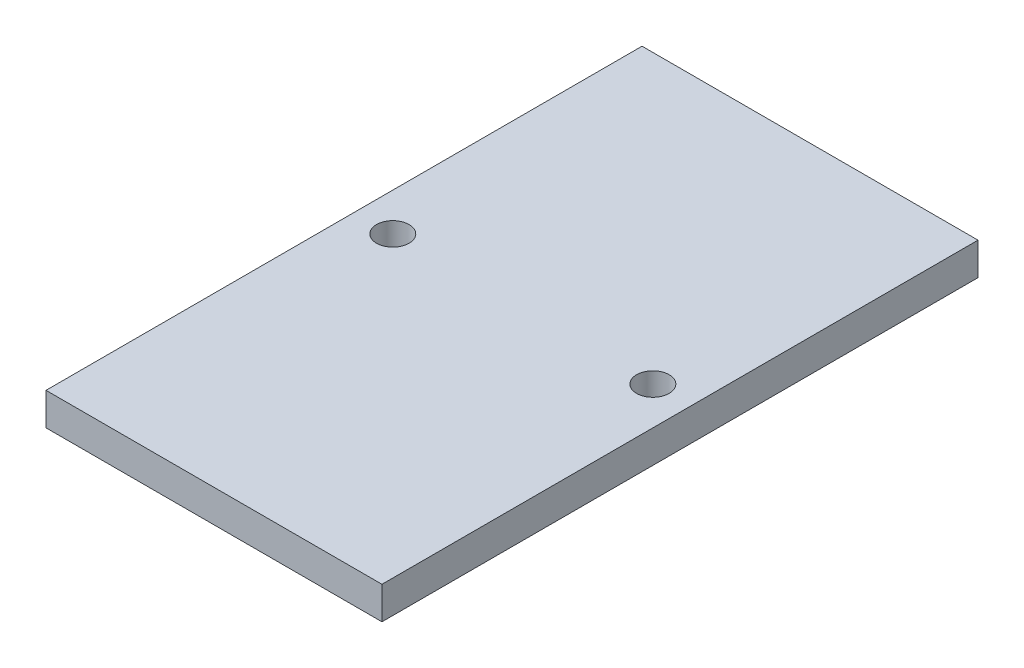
ISO-10303-21;
HEADER;
FILE_DESCRIPTION(('STEP AP214'),'2;1');
FILE_NAME('part.step','',(''),(''),'','','');
FILE_SCHEMA(('AUTOMOTIVE_DESIGN { 1 0 10303 214 1 1 1 1 }'));
ENDSEC;
DATA;
#1=APPLICATION_CONTEXT('core data for automotive mechanical design processes');
#2=APPLICATION_PROTOCOL_DEFINITION('international standard','automotive_design',2000,#1);
#3=PRODUCT_CONTEXT('',#1,'mechanical');
#4=PRODUCT('Part','Part','',(#3));
#5=PRODUCT_RELATED_PRODUCT_CATEGORY('part','',(#4));
#6=PRODUCT_DEFINITION_FORMATION('','',#4);
#7=PRODUCT_DEFINITION_CONTEXT('part definition',#1,'design');
#8=PRODUCT_DEFINITION('design','',#6,#7);
#9=PRODUCT_DEFINITION_SHAPE('','',#8);
#10=(LENGTH_UNIT() NAMED_UNIT(*) SI_UNIT(.MILLI.,.METRE.));
#11=(NAMED_UNIT(*) PLANE_ANGLE_UNIT() SI_UNIT($,.RADIAN.));
#12=(NAMED_UNIT(*) SI_UNIT($,.STERADIAN.) SOLID_ANGLE_UNIT());
#13=UNCERTAINTY_MEASURE_WITH_UNIT(LENGTH_MEASURE(1.E-05),#10,'distance_accuracy_value','');
#14=(GEOMETRIC_REPRESENTATION_CONTEXT(3) GLOBAL_UNCERTAINTY_ASSIGNED_CONTEXT((#13)) GLOBAL_UNIT_ASSIGNED_CONTEXT((#10,
#11,#12)) REPRESENTATION_CONTEXT('',''));
#15=CARTESIAN_POINT('',(0.,0.,0.));
#16=DIRECTION('',(0.,0.,1.));
#17=DIRECTION('',(1.,0.,0.));
#18=AXIS2_PLACEMENT_3D('',#15,#16,#17);
#19=CARTESIAN_POINT('',(0.,6.,-110.));
#20=DIRECTION('',(0.,-1.,0.));
#21=DIRECTION('',(0.,0.,-1.));
#22=AXIS2_PLACEMENT_3D('',#19,#20,#21);
#23=PLANE('',#22);
#24=CARTESIAN_POINT('',(7.,6.,-57.));
#25=DIRECTION('',(0.,1.,0.));
#26=DIRECTION('',(0.,0.,1.));
#27=AXIS2_PLACEMENT_3D('',#24,#25,#26);
#28=CIRCLE('',#27,3.);
#29=CARTESIAN_POINT('',(7.,6.,-54.));
#30=VERTEX_POINT('',#29);
#31=EDGE_CURVE('E91',#30,#30,#28,.T.);
#32=ORIENTED_EDGE('',*,*,#31,.F.);
#33=EDGE_LOOP('',(#32));
#34=FACE_BOUND('',#33,.T.);
#35=DIRECTION('',(0.,0.,1.));
#36=VECTOR('',#35,1.);
#37=CARTESIAN_POINT('',(0.,6.,0.));
#38=LINE('',#37,#36);
#39=CARTESIAN_POINT('',(0.,6.,-110.));
#40=VERTEX_POINT('',#39);
#41=CARTESIAN_POINT('',(0.,6.,0.));
#42=VERTEX_POINT('',#41);
#43=EDGE_CURVE('E101',#40,#42,#38,.T.);
#44=ORIENTED_EDGE('',*,*,#43,.T.);
#45=DIRECTION('',(1.,0.,0.));
#46=VECTOR('',#45,1.);
#47=CARTESIAN_POINT('',(0.,6.,0.));
#48=LINE('',#47,#46);
#49=CARTESIAN_POINT('',(62.,6.,0.));
#50=VERTEX_POINT('',#49);
#51=EDGE_CURVE('E86',#42,#50,#48,.T.);
#52=ORIENTED_EDGE('',*,*,#51,.T.);
#53=DIRECTION('',(0.,0.,-1.));
#54=VECTOR('',#53,1.);
#55=CARTESIAN_POINT('',(62.,6.,0.));
#56=LINE('',#55,#54);
#57=CARTESIAN_POINT('',(62.,6.,-110.));
#58=VERTEX_POINT('',#57);
#59=EDGE_CURVE('E52',#50,#58,#56,.T.);
#60=ORIENTED_EDGE('',*,*,#59,.T.);
#61=DIRECTION('',(-1.,0.,0.));
#62=VECTOR('',#61,1.);
#63=CARTESIAN_POINT('',(0.,6.,-110.));
#64=LINE('',#63,#62);
#65=EDGE_CURVE('E47',#58,#40,#64,.T.);
#66=ORIENTED_EDGE('',*,*,#65,.T.);
#67=EDGE_LOOP('',(#44,#52,#60,#66));
#68=FACE_BOUND('',#67,.T.);
#69=CARTESIAN_POINT('',(55.,6.,-57.));
#70=DIRECTION('',(0.,1.,0.));
#71=DIRECTION('',(0.,0.,1.));
#72=AXIS2_PLACEMENT_3D('',#69,#70,#71);
#73=CIRCLE('',#72,3.);
#74=CARTESIAN_POINT('',(55.,6.,-54.));
#75=VERTEX_POINT('',#74);
#76=EDGE_CURVE('E119',#75,#75,#73,.T.);
#77=ORIENTED_EDGE('',*,*,#76,.F.);
#78=EDGE_LOOP('',(#77));
#79=FACE_BOUND('',#78,.T.);
#80=ADVANCED_FACE('F32',(#34,#68,#79),#23,.F.);
#81=CARTESIAN_POINT('',(0.,0.,-110.));
#82=DIRECTION('',(0.,-1.,0.));
#83=DIRECTION('',(0.,0.,-1.));
#84=AXIS2_PLACEMENT_3D('',#81,#82,#83);
#85=PLANE('',#84);
#86=CARTESIAN_POINT('',(7.,0.,-57.));
#87=DIRECTION('',(0.,1.,0.));
#88=DIRECTION('',(0.,0.,1.));
#89=AXIS2_PLACEMENT_3D('',#86,#87,#88);
#90=CIRCLE('',#89,3.);
#91=CARTESIAN_POINT('',(7.,0.,-54.));
#92=VERTEX_POINT('',#91);
#93=EDGE_CURVE('E94',#92,#92,#90,.T.);
#94=ORIENTED_EDGE('',*,*,#93,.T.);
#95=EDGE_LOOP('',(#94));
#96=FACE_BOUND('',#95,.T.);
#97=DIRECTION('',(0.,0.,1.));
#98=VECTOR('',#97,1.);
#99=CARTESIAN_POINT('',(0.,0.,0.));
#100=LINE('',#99,#98);
#101=CARTESIAN_POINT('',(0.,0.,-110.));
#102=VERTEX_POINT('',#101);
#103=CARTESIAN_POINT('',(0.,0.,0.));
#104=VERTEX_POINT('',#103);
#105=EDGE_CURVE('E78',#102,#104,#100,.T.);
#106=ORIENTED_EDGE('',*,*,#105,.F.);
#107=DIRECTION('',(-1.,0.,0.));
#108=VECTOR('',#107,1.);
#109=CARTESIAN_POINT('',(0.,0.,-110.));
#110=LINE('',#109,#108);
#111=CARTESIAN_POINT('',(62.,0.,-110.));
#112=VERTEX_POINT('',#111);
#113=EDGE_CURVE('E99',#112,#102,#110,.T.);
#114=ORIENTED_EDGE('',*,*,#113,.F.);
#115=DIRECTION('',(0.,0.,-1.));
#116=VECTOR('',#115,1.);
#117=CARTESIAN_POINT('',(62.,0.,0.));
#118=LINE('',#117,#116);
#119=CARTESIAN_POINT('',(62.,0.,0.));
#120=VERTEX_POINT('',#119);
#121=EDGE_CURVE('E79',#120,#112,#118,.T.);
#122=ORIENTED_EDGE('',*,*,#121,.F.);
#123=DIRECTION('',(1.,0.,0.));
#124=VECTOR('',#123,1.);
#125=CARTESIAN_POINT('',(0.,0.,0.));
#126=LINE('',#125,#124);
#127=EDGE_CURVE('E73',#104,#120,#126,.T.);
#128=ORIENTED_EDGE('',*,*,#127,.F.);
#129=EDGE_LOOP('',(#106,#114,#122,#128));
#130=FACE_BOUND('',#129,.T.);
#131=CARTESIAN_POINT('',(55.,0.,-57.));
#132=DIRECTION('',(0.,1.,0.));
#133=DIRECTION('',(0.,0.,1.));
#134=AXIS2_PLACEMENT_3D('',#131,#132,#133);
#135=CIRCLE('',#134,3.);
#136=CARTESIAN_POINT('',(55.,0.,-54.));
#137=VERTEX_POINT('',#136);
#138=EDGE_CURVE('E121',#137,#137,#135,.T.);
#139=ORIENTED_EDGE('',*,*,#138,.T.);
#140=EDGE_LOOP('',(#139));
#141=FACE_BOUND('',#140,.T.);
#142=ADVANCED_FACE('F74',(#96,#130,#141),#85,.T.);
#143=CARTESIAN_POINT('',(0.,6.,0.));
#144=DIRECTION('',(1.,0.,0.));
#145=DIRECTION('',(0.,0.,-1.));
#146=AXIS2_PLACEMENT_3D('',#143,#144,#145);
#147=PLANE('',#146);
#148=ORIENTED_EDGE('',*,*,#105,.T.);
#149=DIRECTION('',(0.,-1.,0.));
#150=VECTOR('',#149,1.);
#151=CARTESIAN_POINT('',(0.,6.,0.));
#152=LINE('',#151,#150);
#153=EDGE_CURVE('E11',#42,#104,#152,.T.);
#154=ORIENTED_EDGE('',*,*,#153,.F.);
#155=ORIENTED_EDGE('',*,*,#43,.F.);
#156=DIRECTION('',(0.,-1.,0.));
#157=VECTOR('',#156,1.);
#158=CARTESIAN_POINT('',(0.,6.,-110.));
#159=LINE('',#158,#157);
#160=EDGE_CURVE('E90',#40,#102,#159,.T.);
#161=ORIENTED_EDGE('',*,*,#160,.T.);
#162=EDGE_LOOP('',(#148,#154,#155,#161));
#163=FACE_BOUND('',#162,.T.);
#164=ADVANCED_FACE('F34',(#163),#147,.F.);
#165=CARTESIAN_POINT('',(0.,6.,0.));
#166=DIRECTION('',(0.,0.,-1.));
#167=DIRECTION('',(-1.,0.,0.));
#168=AXIS2_PLACEMENT_3D('',#165,#166,#167);
#169=PLANE('',#168);
#170=ORIENTED_EDGE('',*,*,#127,.T.);
#171=DIRECTION('',(0.,-1.,0.));
#172=VECTOR('',#171,1.);
#173=CARTESIAN_POINT('',(62.,6.,0.));
#174=LINE('',#173,#172);
#175=EDGE_CURVE('E40',#50,#120,#174,.T.);
#176=ORIENTED_EDGE('',*,*,#175,.F.);
#177=ORIENTED_EDGE('',*,*,#51,.F.);
#178=ORIENTED_EDGE('',*,*,#153,.T.);
#179=EDGE_LOOP('',(#170,#176,#177,#178));
#180=FACE_BOUND('',#179,.T.);
#181=ADVANCED_FACE('F85',(#180),#169,.F.);
#182=CARTESIAN_POINT('',(62.,6.,0.));
#183=DIRECTION('',(-1.,0.,0.));
#184=DIRECTION('',(0.,0.,1.));
#185=AXIS2_PLACEMENT_3D('',#182,#183,#184);
#186=PLANE('',#185);
#187=ORIENTED_EDGE('',*,*,#121,.T.);
#188=DIRECTION('',(0.,-1.,0.));
#189=VECTOR('',#188,1.);
#190=CARTESIAN_POINT('',(62.,6.,-110.));
#191=LINE('',#190,#189);
#192=EDGE_CURVE('E107',#58,#112,#191,.T.);
#193=ORIENTED_EDGE('',*,*,#192,.F.);
#194=ORIENTED_EDGE('',*,*,#59,.F.);
#195=ORIENTED_EDGE('',*,*,#175,.T.);
#196=EDGE_LOOP('',(#187,#193,#194,#195));
#197=FACE_BOUND('',#196,.T.);
#198=ADVANCED_FACE('F110',(#197),#186,.F.);
#199=CARTESIAN_POINT('',(0.,6.,-110.));
#200=DIRECTION('',(0.,0.,1.));
#201=DIRECTION('',(1.,0.,0.));
#202=AXIS2_PLACEMENT_3D('',#199,#200,#201);
#203=PLANE('',#202);
#204=ORIENTED_EDGE('',*,*,#113,.T.);
#205=ORIENTED_EDGE('',*,*,#160,.F.);
#206=ORIENTED_EDGE('',*,*,#65,.F.);
#207=ORIENTED_EDGE('',*,*,#192,.T.);
#208=EDGE_LOOP('',(#204,#205,#206,#207));
#209=FACE_BOUND('',#208,.T.);
#210=ADVANCED_FACE('F112',(#209),#203,.F.);
#211=CARTESIAN_POINT('',(7.,6.,-57.));
#212=DIRECTION('',(0.,-1.,0.));
#213=DIRECTION('',(0.,0.,-1.));
#214=AXIS2_PLACEMENT_3D('',#211,#212,#213);
#215=CYLINDRICAL_SURFACE('',#214,3.);
#216=ORIENTED_EDGE('',*,*,#31,.T.);
#217=EDGE_LOOP('',(#216));
#218=FACE_BOUND('',#217,.T.);
#219=ORIENTED_EDGE('',*,*,#93,.F.);
#220=EDGE_LOOP('',(#219));
#221=FACE_BOUND('',#220,.T.);
#222=ADVANCED_FACE('F130',(#218,#221),#215,.F.);
#223=CARTESIAN_POINT('',(55.,6.,-57.));
#224=DIRECTION('',(0.,-1.,0.));
#225=DIRECTION('',(0.,0.,-1.));
#226=AXIS2_PLACEMENT_3D('',#223,#224,#225);
#227=CYLINDRICAL_SURFACE('',#226,3.);
#228=ORIENTED_EDGE('',*,*,#76,.T.);
#229=EDGE_LOOP('',(#228));
#230=FACE_BOUND('',#229,.T.);
#231=ORIENTED_EDGE('',*,*,#138,.F.);
#232=EDGE_LOOP('',(#231));
#233=FACE_BOUND('',#232,.T.);
#234=ADVANCED_FACE('F128',(#230,#233),#227,.F.);
#235=CLOSED_SHELL('',(#80,#142,#164,#181,#198,#210,#222,#234));
#236=MANIFOLD_SOLID_BREP('B2',#235);
#237=ADVANCED_BREP_SHAPE_REPRESENTATION('',(#18,#236),#14);
#238=SHAPE_DEFINITION_REPRESENTATION(#9,#237);
ENDSEC;
END-ISO-10303-21;
